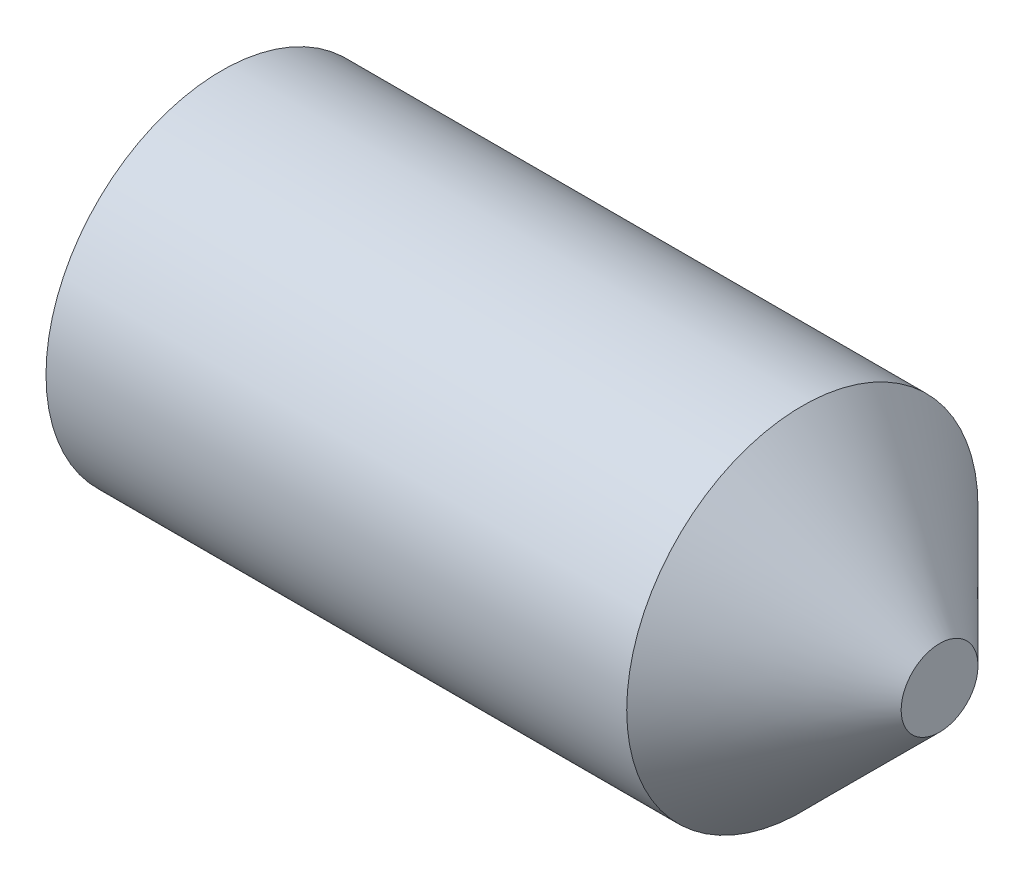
ISO-10303-21;
HEADER;
FILE_DESCRIPTION(('STEP AP214'),'2;1');
FILE_NAME('part.step','',(''),(''),'','','');
FILE_SCHEMA(('AUTOMOTIVE_DESIGN { 1 0 10303 214 1 1 1 1 }'));
ENDSEC;
DATA;
#1=APPLICATION_CONTEXT('core data for automotive mechanical design processes');
#2=APPLICATION_PROTOCOL_DEFINITION('international standard','automotive_design',2000,#1);
#3=PRODUCT_CONTEXT('',#1,'mechanical');
#4=PRODUCT('Part','Part','',(#3));
#5=PRODUCT_RELATED_PRODUCT_CATEGORY('part','',(#4));
#6=PRODUCT_DEFINITION_FORMATION('','',#4);
#7=PRODUCT_DEFINITION_CONTEXT('part definition',#1,'design');
#8=PRODUCT_DEFINITION('design','',#6,#7);
#9=PRODUCT_DEFINITION_SHAPE('','',#8);
#10=(LENGTH_UNIT() NAMED_UNIT(*) SI_UNIT(.MILLI.,.METRE.));
#11=(NAMED_UNIT(*) PLANE_ANGLE_UNIT() SI_UNIT($,.RADIAN.));
#12=(NAMED_UNIT(*) SI_UNIT($,.STERADIAN.) SOLID_ANGLE_UNIT());
#13=UNCERTAINTY_MEASURE_WITH_UNIT(LENGTH_MEASURE(1.E-05),#10,'distance_accuracy_value','');
#14=(GEOMETRIC_REPRESENTATION_CONTEXT(3) GLOBAL_UNCERTAINTY_ASSIGNED_CONTEXT((#13)) GLOBAL_UNIT_ASSIGNED_CONTEXT((#10,
#11,#12)) REPRESENTATION_CONTEXT('',''));
#15=CARTESIAN_POINT('',(0.,0.,0.));
#16=DIRECTION('',(0.,0.,1.));
#17=DIRECTION('',(1.,0.,0.));
#18=AXIS2_PLACEMENT_3D('',#15,#16,#17);
#19=CARTESIAN_POINT('',(0.,0.,0.));
#20=DIRECTION('',(-1.,0.,0.));
#21=DIRECTION('',(0.,0.,1.));
#22=AXIS2_PLACEMENT_3D('',#19,#20,#21);
#23=PLANE('',#22);
#24=CARTESIAN_POINT('',(0.,0.,0.));
#25=DIRECTION('',(-1.,0.,0.));
#26=DIRECTION('',(0.,0.,1.));
#27=AXIS2_PLACEMENT_3D('',#24,#25,#26);
#28=CIRCLE('',#27,10.352);
#29=CARTESIAN_POINT('',(0.,0.,10.352));
#30=VERTEX_POINT('',#29);
#31=EDGE_CURVE('E11',#30,#30,#28,.T.);
#32=ORIENTED_EDGE('',*,*,#31,.T.);
#33=EDGE_LOOP('',(#32));
#34=FACE_BOUND('',#33,.T.);
#35=DIRECTION('',(0.,0.,-1.));
#36=VECTOR('',#35,1.);
#37=CARTESIAN_POINT('',(0.,6.,3.46410161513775));
#38=LINE('',#37,#36);
#39=CARTESIAN_POINT('',(0.,6.,3.46410161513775));
#40=VERTEX_POINT('',#39);
#41=CARTESIAN_POINT('',(0.,6.,-3.46410161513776));
#42=VERTEX_POINT('',#41);
#43=EDGE_CURVE('E131',#40,#42,#38,.T.);
#44=ORIENTED_EDGE('',*,*,#43,.F.);
#45=DIRECTION('',(0.,-0.866025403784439,0.5));
#46=VECTOR('',#45,1.);
#47=CARTESIAN_POINT('',(0.,6.,3.46410161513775));
#48=LINE('',#47,#46);
#49=CARTESIAN_POINT('',(0.,0.,6.9282032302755));
#50=VERTEX_POINT('',#49);
#51=EDGE_CURVE('E54',#40,#50,#48,.T.);
#52=ORIENTED_EDGE('',*,*,#51,.T.);
#53=DIRECTION('',(0.,0.866025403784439,0.5));
#54=VECTOR('',#53,1.);
#55=CARTESIAN_POINT('',(0.,-5.99999999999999,3.46410161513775));
#56=LINE('',#55,#54);
#57=CARTESIAN_POINT('',(0.,-5.99999999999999,3.46410161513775));
#58=VERTEX_POINT('',#57);
#59=EDGE_CURVE('E121',#58,#50,#56,.T.);
#60=ORIENTED_EDGE('',*,*,#59,.F.);
#61=DIRECTION('',(0.,0.,-1.));
#62=VECTOR('',#61,1.);
#63=CARTESIAN_POINT('',(0.,-5.99999999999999,3.46410161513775));
#64=LINE('',#63,#62);
#65=CARTESIAN_POINT('',(0.,-5.99999999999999,-3.46410161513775));
#66=VERTEX_POINT('',#65);
#67=EDGE_CURVE('E126',#58,#66,#64,.T.);
#68=ORIENTED_EDGE('',*,*,#67,.T.);
#69=DIRECTION('',(0.,0.866025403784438,-0.5));
#70=VECTOR('',#69,1.);
#71=CARTESIAN_POINT('',(0.,-5.99999999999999,-3.46410161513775));
#72=LINE('',#71,#70);
#73=CARTESIAN_POINT('',(0.,0.,-6.92820323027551));
#74=VERTEX_POINT('',#73);
#75=EDGE_CURVE('E127',#66,#74,#72,.T.);
#76=ORIENTED_EDGE('',*,*,#75,.T.);
#77=DIRECTION('',(0.,-0.866025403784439,-0.5));
#78=VECTOR('',#77,1.);
#79=CARTESIAN_POINT('',(0.,6.,-3.46410161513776));
#80=LINE('',#79,#78);
#81=EDGE_CURVE('E113',#42,#74,#80,.T.);
#82=ORIENTED_EDGE('',*,*,#81,.F.);
#83=EDGE_LOOP('',(#44,#52,#60,#68,#76,#82));
#84=FACE_BOUND('',#83,.T.);
#85=ADVANCED_FACE('F41',(#34,#84),#23,.T.);
#86=CARTESIAN_POINT('',(0.,0.,0.));
#87=DIRECTION('',(1.,0.,0.));
#88=DIRECTION('',(0.,0.,-1.));
#89=AXIS2_PLACEMENT_3D('',#86,#87,#88);
#90=CONICAL_SURFACE('',#89,10.352,1.0471975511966);
#91=CARTESIAN_POINT('',(0.951473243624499,0.,0.));
#92=DIRECTION('',(-1.,0.,0.));
#93=DIRECTION('',(0.,0.,1.));
#94=AXIS2_PLACEMENT_3D('',#91,#92,#93);
#95=CIRCLE('',#94,12.);
#96=CARTESIAN_POINT('',(0.951473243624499,0.,12.));
#97=VERTEX_POINT('',#96);
#98=EDGE_CURVE('E48',#97,#97,#95,.T.);
#99=ORIENTED_EDGE('',*,*,#98,.T.);
#100=EDGE_LOOP('',(#99));
#101=FACE_BOUND('',#100,.T.);
#102=ORIENTED_EDGE('',*,*,#31,.F.);
#103=EDGE_LOOP('',(#102));
#104=FACE_BOUND('',#103,.T.);
#105=ADVANCED_FACE('F147',(#101,#104),#90,.T.);
#106=CARTESIAN_POINT('',(-12.7,0.,0.));
#107=DIRECTION('',(-1.,0.,0.));
#108=DIRECTION('',(0.,0.,1.));
#109=AXIS2_PLACEMENT_3D('',#106,#107,#108);
#110=CYLINDRICAL_SURFACE('',#109,12.);
#111=CARTESIAN_POINT('',(40.625,0.,0.));
#112=DIRECTION('',(-1.,0.,0.));
#113=DIRECTION('',(0.,0.,1.));
#114=AXIS2_PLACEMENT_3D('',#111,#112,#113);
#115=CIRCLE('',#114,12.);
#116=CARTESIAN_POINT('',(40.625,0.,12.));
#117=VERTEX_POINT('',#116);
#118=EDGE_CURVE('E143',#117,#117,#115,.T.);
#119=ORIENTED_EDGE('',*,*,#118,.T.);
#120=EDGE_LOOP('',(#119));
#121=FACE_BOUND('',#120,.T.);
#122=ORIENTED_EDGE('',*,*,#98,.F.);
#123=EDGE_LOOP('',(#122));
#124=FACE_BOUND('',#123,.T.);
#125=ADVANCED_FACE('F151',(#121,#124),#110,.T.);
#126=CARTESIAN_POINT('',(40.625,0.,0.));
#127=DIRECTION('',(-1.,0.,0.));
#128=DIRECTION('',(0.,0.,1.));
#129=AXIS2_PLACEMENT_3D('',#126,#127,#128);
#130=CONICAL_SURFACE('',#129,12.,0.785398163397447);
#131=CARTESIAN_POINT('',(50.,0.,0.));
#132=DIRECTION('',(-1.,0.,0.));
#133=DIRECTION('',(0.,0.,1.));
#134=AXIS2_PLACEMENT_3D('',#131,#132,#133);
#135=CIRCLE('',#134,2.625);
#136=CARTESIAN_POINT('',(50.,0.,2.625));
#137=VERTEX_POINT('',#136);
#138=EDGE_CURVE('E145',#137,#137,#135,.T.);
#139=CARTESIAN_POINT('',(50.,0.,2.625));
#140=CARTESIAN_POINT('',(49.90234375,0.,2.72265625));
#141=CARTESIAN_POINT('',(49.8046875,0.,2.8203125));
#142=CARTESIAN_POINT('',(49.609375,0.,3.015625));
#143=CARTESIAN_POINT('',(49.51171875,0.,3.11328125));
#144=CARTESIAN_POINT('',(49.31640625,0.,3.30859375));
#145=CARTESIAN_POINT('',(49.21875,0.,3.40625));
#146=CARTESIAN_POINT('',(49.0234375,0.,3.6015625));
#147=CARTESIAN_POINT('',(48.92578125,0.,3.69921875));
#148=CARTESIAN_POINT('',(48.73046875,0.,3.89453125));
#149=CARTESIAN_POINT('',(48.6328125,0.,3.9921875));
#150=CARTESIAN_POINT('',(48.4375,0.,4.1875));
#151=CARTESIAN_POINT('',(48.33984375,0.,4.28515625));
#152=CARTESIAN_POINT('',(48.14453125,0.,4.48046875));
#153=CARTESIAN_POINT('',(48.046875,0.,4.578125));
#154=CARTESIAN_POINT('',(47.8515625,0.,4.7734375));
#155=CARTESIAN_POINT('',(47.75390625,0.,4.87109375));
#156=CARTESIAN_POINT('',(47.55859375,0.,5.06640625));
#157=CARTESIAN_POINT('',(47.4609375,0.,5.1640625));
#158=CARTESIAN_POINT('',(47.265625,0.,5.359375));
#159=CARTESIAN_POINT('',(47.16796875,0.,5.45703125));
#160=CARTESIAN_POINT('',(46.97265625,0.,5.65234375));
#161=CARTESIAN_POINT('',(46.875,0.,5.75));
#162=CARTESIAN_POINT('',(46.6796875,0.,5.9453125));
#163=CARTESIAN_POINT('',(46.58203125,0.,6.04296875));
#164=CARTESIAN_POINT('',(46.38671875,0.,6.23828125));
#165=CARTESIAN_POINT('',(46.2890625,0.,6.3359375));
#166=CARTESIAN_POINT('',(46.09375,0.,6.53125));
#167=CARTESIAN_POINT('',(45.99609375,0.,6.62890625));
#168=CARTESIAN_POINT('',(45.80078125,0.,6.82421875));
#169=CARTESIAN_POINT('',(45.703125,0.,6.921875));
#170=CARTESIAN_POINT('',(45.5078125,0.,7.1171875));
#171=CARTESIAN_POINT('',(45.41015625,0.,7.21484375));
#172=CARTESIAN_POINT('',(45.21484375,0.,7.41015625));
#173=CARTESIAN_POINT('',(45.1171875,0.,7.5078125));
#174=CARTESIAN_POINT('',(44.921875,0.,7.703125));
#175=CARTESIAN_POINT('',(44.82421875,0.,7.80078125));
#176=CARTESIAN_POINT('',(44.62890625,0.,7.99609375));
#177=CARTESIAN_POINT('',(44.53125,0.,8.09375));
#178=CARTESIAN_POINT('',(44.3359375,0.,8.2890625));
#179=CARTESIAN_POINT('',(44.23828125,0.,8.38671875));
#180=CARTESIAN_POINT('',(44.04296875,0.,8.58203125));
#181=CARTESIAN_POINT('',(43.9453125,0.,8.6796875));
#182=CARTESIAN_POINT('',(43.75,0.,8.875));
#183=CARTESIAN_POINT('',(43.65234375,0.,8.97265625));
#184=CARTESIAN_POINT('',(43.45703125,0.,9.16796875));
#185=CARTESIAN_POINT('',(43.359375,0.,9.265625));
#186=CARTESIAN_POINT('',(43.1640625,0.,9.4609375));
#187=CARTESIAN_POINT('',(43.06640625,0.,9.55859375));
#188=CARTESIAN_POINT('',(42.87109375,0.,9.75390625));
#189=CARTESIAN_POINT('',(42.7734375,0.,9.8515625));
#190=CARTESIAN_POINT('',(42.578125,0.,10.046875));
#191=CARTESIAN_POINT('',(42.48046875,0.,10.14453125));
#192=CARTESIAN_POINT('',(42.28515625,0.,10.33984375));
#193=CARTESIAN_POINT('',(42.1875,0.,10.4375));
#194=CARTESIAN_POINT('',(41.9921875,0.,10.6328125));
#195=CARTESIAN_POINT('',(41.89453125,0.,10.73046875));
#196=CARTESIAN_POINT('',(41.69921875,0.,10.92578125));
#197=CARTESIAN_POINT('',(41.6015625,0.,11.0234375));
#198=CARTESIAN_POINT('',(41.40625,0.,11.21875));
#199=CARTESIAN_POINT('',(41.30859375,0.,11.31640625));
#200=CARTESIAN_POINT('',(41.11328125,0.,11.51171875));
#201=CARTESIAN_POINT('',(41.015625,0.,11.609375));
#202=CARTESIAN_POINT('',(40.8203125,0.,11.8046875));
#203=CARTESIAN_POINT('',(40.72265625,0.,11.90234375));
#204=CARTESIAN_POINT('',(40.625,0.,12.));
#205=B_SPLINE_CURVE_WITH_KNOTS('',3,(#139,#140,#141,#142,#143,#144,#145,#146,#147,#148,#149,
#150,#151,#152,#153,#154,#155,#156,#157,#158,#159,#160,#161,#162,#163,#164,#165,#166,#167,#168,
#169,#170,#171,#172,#173,#174,#175,#176,#177,#178,#179,#180,#181,#182,#183,#184,#185,#186,#187,
#188,#189,#190,#191,#192,#193,#194,#195,#196,#197,#198,#199,#200,#201,#202,#203,#204),
.UNSPECIFIED.,.F.,.F.,(4,2,2,2,2,2,2,2,2,2,2,2,2,2,2,2,2,2,2,2,2,2,2,2,2,2,2,2,2,2,2,2,4),(0.,
0.414320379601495,0.828640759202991,1.24296113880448,1.65728151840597,2.07160189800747,
2.48592227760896,2.90024265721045,3.31456303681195,3.72888341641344,4.14320379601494,
4.55752417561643,4.97184455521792,5.38616493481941,5.80048531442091,6.2148056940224,
6.6291260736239,7.04344645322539,7.45776683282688,7.87208721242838,8.28640759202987,
8.70072797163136,9.11504835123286,9.52936873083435,9.94368911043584,10.3580094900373,
10.7723298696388,11.1866502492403,11.6009706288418,12.0152910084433,12.4296113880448,
12.8439317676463,13.2582521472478),.UNSPECIFIED.);
#206=EDGE_CURVE('BSEAM154',#137,#117,#205,.T.);
#207=ORIENTED_EDGE('',*,*,#138,.T.);
#208=ORIENTED_EDGE('',*,*,#118,.F.);
#209=ORIENTED_EDGE('',*,*,#206,.T.);
#210=ORIENTED_EDGE('',*,*,#206,.F.);
#211=EDGE_LOOP('',(#207,#209,#208,#210));
#212=FACE_BOUND('',#211,.T.);
#213=ADVANCED_FACE('F154',(#212),#130,.T.);
#214=CARTESIAN_POINT('',(50.,2.625,0.));
#215=DIRECTION('',(1.,0.,0.));
#216=DIRECTION('',(0.,0.,-1.));
#217=AXIS2_PLACEMENT_3D('',#214,#215,#216);
#218=PLANE('',#217);
#219=ORIENTED_EDGE('',*,*,#138,.F.);
#220=EDGE_LOOP('',(#219));
#221=FACE_BOUND('',#220,.T.);
#222=ADVANCED_FACE('F163',(#221),#218,.T.);
#223=CARTESIAN_POINT('',(15.,6.,3.46410161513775));
#224=DIRECTION('',(0.,-0.5,-0.866025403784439));
#225=DIRECTION('',(0.,0.866025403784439,-0.5));
#226=AXIS2_PLACEMENT_3D('',#223,#224,#225);
#227=PLANE('',#226);
#228=ORIENTED_EDGE('',*,*,#51,.F.);
#229=DIRECTION('',(-1.,0.,0.));
#230=VECTOR('',#229,1.);
#231=CARTESIAN_POINT('',(15.,6.,3.46410161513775));
#232=LINE('',#231,#230);
#233=CARTESIAN_POINT('',(15.,6.,3.46410161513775));
#234=VERTEX_POINT('',#233);
#235=EDGE_CURVE('E58',#234,#40,#232,.T.);
#236=ORIENTED_EDGE('',*,*,#235,.F.);
#237=DIRECTION('',(0.,-0.866025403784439,0.5));
#238=VECTOR('',#237,1.);
#239=CARTESIAN_POINT('',(15.,6.,3.46410161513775));
#240=LINE('',#239,#238);
#241=CARTESIAN_POINT('',(15.,0.,6.9282032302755));
#242=VERTEX_POINT('',#241);
#243=EDGE_CURVE('E90',#234,#242,#240,.T.);
#244=ORIENTED_EDGE('',*,*,#243,.T.);
#245=DIRECTION('',(-1.,0.,0.));
#246=VECTOR('',#245,1.);
#247=CARTESIAN_POINT('',(15.,0.,6.9282032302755));
#248=LINE('',#247,#246);
#249=EDGE_CURVE('E140',#242,#50,#248,.T.);
#250=ORIENTED_EDGE('',*,*,#249,.T.);
#251=EDGE_LOOP('',(#228,#236,#244,#250));
#252=FACE_BOUND('',#251,.T.);
#253=ADVANCED_FACE('F192',(#252),#227,.T.);
#254=CARTESIAN_POINT('',(15.,-5.99999999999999,3.46410161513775));
#255=DIRECTION('',(0.,-0.5,0.866025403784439));
#256=DIRECTION('',(0.,-0.866025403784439,-0.5));
#257=AXIS2_PLACEMENT_3D('',#254,#255,#256);
#258=PLANE('',#257);
#259=ORIENTED_EDGE('',*,*,#59,.T.);
#260=ORIENTED_EDGE('',*,*,#249,.F.);
#261=DIRECTION('',(0.,0.866025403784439,0.5));
#262=VECTOR('',#261,1.);
#263=CARTESIAN_POINT('',(15.,-5.99999999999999,3.46410161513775));
#264=LINE('',#263,#262);
#265=CARTESIAN_POINT('',(15.,-5.99999999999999,3.46410161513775));
#266=VERTEX_POINT('',#265);
#267=EDGE_CURVE('E271',#266,#242,#264,.T.);
#268=ORIENTED_EDGE('',*,*,#267,.F.);
#269=DIRECTION('',(-1.,0.,0.));
#270=VECTOR('',#269,1.);
#271=CARTESIAN_POINT('',(15.,-5.99999999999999,3.46410161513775));
#272=LINE('',#271,#270);
#273=EDGE_CURVE('E139',#266,#58,#272,.T.);
#274=ORIENTED_EDGE('',*,*,#273,.T.);
#275=EDGE_LOOP('',(#259,#260,#268,#274));
#276=FACE_BOUND('',#275,.T.);
#277=ADVANCED_FACE('F194',(#276),#258,.F.);
#278=CARTESIAN_POINT('',(15.,-5.99999999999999,3.46410161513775));
#279=DIRECTION('',(0.,1.,0.));
#280=DIRECTION('',(0.,0.,1.));
#281=AXIS2_PLACEMENT_3D('',#278,#279,#280);
#282=PLANE('',#281);
#283=ORIENTED_EDGE('',*,*,#67,.F.);
#284=ORIENTED_EDGE('',*,*,#273,.F.);
#285=DIRECTION('',(0.,0.,-1.));
#286=VECTOR('',#285,1.);
#287=CARTESIAN_POINT('',(15.,-5.99999999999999,3.46410161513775));
#288=LINE('',#287,#286);
#289=CARTESIAN_POINT('',(15.,-5.99999999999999,-3.46410161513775));
#290=VERTEX_POINT('',#289);
#291=EDGE_CURVE('E108',#266,#290,#288,.T.);
#292=ORIENTED_EDGE('',*,*,#291,.T.);
#293=DIRECTION('',(-1.,0.,0.));
#294=VECTOR('',#293,1.);
#295=CARTESIAN_POINT('',(15.,-5.99999999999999,-3.46410161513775));
#296=LINE('',#295,#294);
#297=EDGE_CURVE('E101',#290,#66,#296,.T.);
#298=ORIENTED_EDGE('',*,*,#297,.T.);
#299=EDGE_LOOP('',(#283,#284,#292,#298));
#300=FACE_BOUND('',#299,.T.);
#301=ADVANCED_FACE('F189',(#300),#282,.T.);
#302=CARTESIAN_POINT('',(15.,-5.99999999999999,-3.46410161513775));
#303=DIRECTION('',(0.,0.5,0.866025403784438));
#304=DIRECTION('',(0.,-0.866025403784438,0.5));
#305=AXIS2_PLACEMENT_3D('',#302,#303,#304);
#306=PLANE('',#305);
#307=ORIENTED_EDGE('',*,*,#75,.F.);
#308=ORIENTED_EDGE('',*,*,#297,.F.);
#309=DIRECTION('',(0.,0.866025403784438,-0.5));
#310=VECTOR('',#309,1.);
#311=CARTESIAN_POINT('',(15.,-5.99999999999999,-3.46410161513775));
#312=LINE('',#311,#310);
#313=CARTESIAN_POINT('',(15.,0.,-6.92820323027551));
#314=VERTEX_POINT('',#313);
#315=EDGE_CURVE('E96',#290,#314,#312,.T.);
#316=ORIENTED_EDGE('',*,*,#315,.T.);
#317=DIRECTION('',(-1.,0.,0.));
#318=VECTOR('',#317,1.);
#319=CARTESIAN_POINT('',(15.,0.,-6.92820323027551));
#320=LINE('',#319,#318);
#321=EDGE_CURVE('E105',#314,#74,#320,.T.);
#322=ORIENTED_EDGE('',*,*,#321,.T.);
#323=EDGE_LOOP('',(#307,#308,#316,#322));
#324=FACE_BOUND('',#323,.T.);
#325=ADVANCED_FACE('F103',(#324),#306,.T.);
#326=CARTESIAN_POINT('',(15.,6.,-3.46410161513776));
#327=DIRECTION('',(0.,0.5,-0.866025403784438));
#328=DIRECTION('',(0.,0.866025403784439,0.5));
#329=AXIS2_PLACEMENT_3D('',#326,#327,#328);
#330=PLANE('',#329);
#331=ORIENTED_EDGE('',*,*,#81,.T.);
#332=ORIENTED_EDGE('',*,*,#321,.F.);
#333=DIRECTION('',(0.,-0.866025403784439,-0.5));
#334=VECTOR('',#333,1.);
#335=CARTESIAN_POINT('',(15.,6.,-3.46410161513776));
#336=LINE('',#335,#334);
#337=CARTESIAN_POINT('',(15.,6.,-3.46410161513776));
#338=VERTEX_POINT('',#337);
#339=EDGE_CURVE('E110',#338,#314,#336,.T.);
#340=ORIENTED_EDGE('',*,*,#339,.F.);
#341=DIRECTION('',(-1.,0.,0.));
#342=VECTOR('',#341,1.);
#343=CARTESIAN_POINT('',(15.,6.,-3.46410161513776));
#344=LINE('',#343,#342);
#345=EDGE_CURVE('E85',#338,#42,#344,.T.);
#346=ORIENTED_EDGE('',*,*,#345,.T.);
#347=EDGE_LOOP('',(#331,#332,#340,#346));
#348=FACE_BOUND('',#347,.T.);
#349=ADVANCED_FACE('F109',(#348),#330,.F.);
#350=CARTESIAN_POINT('',(15.,6.,3.46410161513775));
#351=DIRECTION('',(0.,1.,0.));
#352=DIRECTION('',(0.,0.,1.));
#353=AXIS2_PLACEMENT_3D('',#350,#351,#352);
#354=PLANE('',#353);
#355=ORIENTED_EDGE('',*,*,#43,.T.);
#356=ORIENTED_EDGE('',*,*,#345,.F.);
#357=DIRECTION('',(0.,0.,-1.));
#358=VECTOR('',#357,1.);
#359=CARTESIAN_POINT('',(15.,6.,3.46410161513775));
#360=LINE('',#359,#358);
#361=EDGE_CURVE('E117',#234,#338,#360,.T.);
#362=ORIENTED_EDGE('',*,*,#361,.F.);
#363=ORIENTED_EDGE('',*,*,#235,.T.);
#364=EDGE_LOOP('',(#355,#356,#362,#363));
#365=FACE_BOUND('',#364,.T.);
#366=ADVANCED_FACE('F176',(#365),#354,.F.);
#367=CARTESIAN_POINT('',(15.,12.,0.));
#368=DIRECTION('',(1.,0.,0.));
#369=DIRECTION('',(0.,0.,-1.));
#370=AXIS2_PLACEMENT_3D('',#367,#368,#369);
#371=PLANE('',#370);
#372=ORIENTED_EDGE('',*,*,#243,.F.);
#373=ORIENTED_EDGE('',*,*,#361,.T.);
#374=ORIENTED_EDGE('',*,*,#339,.T.);
#375=ORIENTED_EDGE('',*,*,#315,.F.);
#376=ORIENTED_EDGE('',*,*,#291,.F.);
#377=ORIENTED_EDGE('',*,*,#267,.T.);
#378=EDGE_LOOP('',(#372,#373,#374,#375,#376,#377));
#379=FACE_BOUND('',#378,.T.);
#380=ADVANCED_FACE('F116',(#379),#371,.F.);
#381=CLOSED_SHELL('',(#85,#105,#125,#213,#222,#253,#277,#301,#325,#349,#366,#380));
#382=MANIFOLD_SOLID_BREP('B2',#381);
#383=ADVANCED_BREP_SHAPE_REPRESENTATION('',(#18,#382),#14);
#384=SHAPE_DEFINITION_REPRESENTATION(#9,#383);
ENDSEC;
END-ISO-10303-21;
